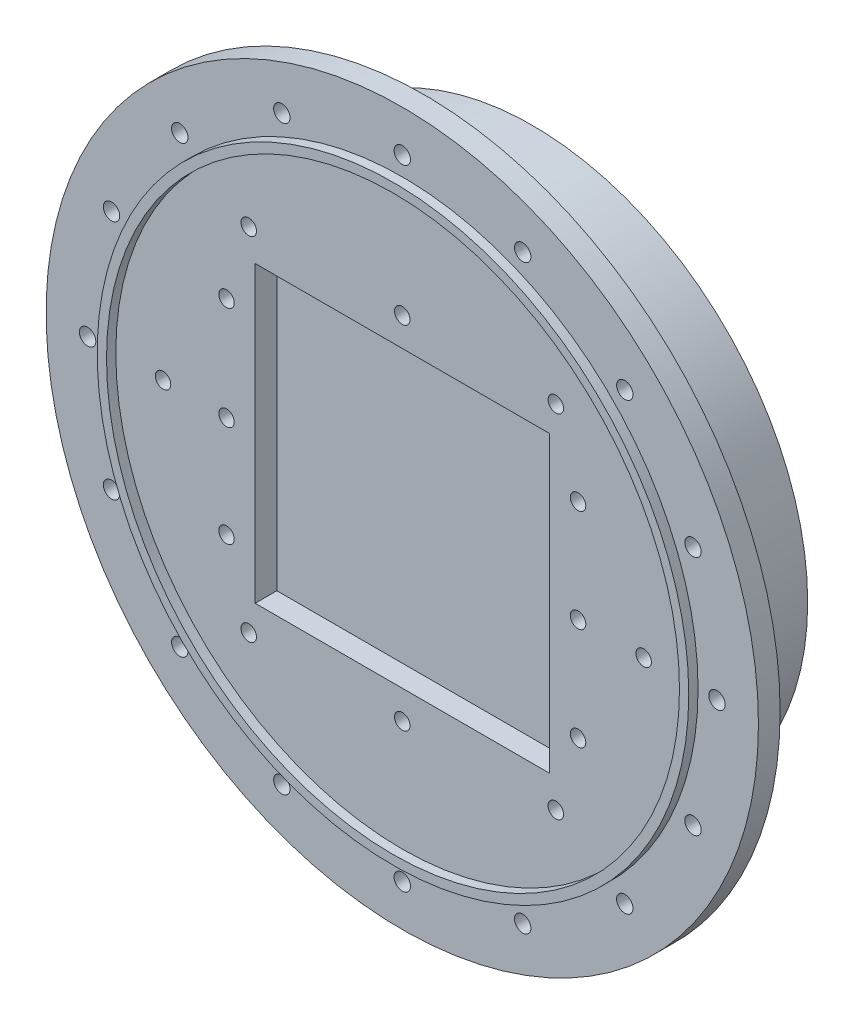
from build123d import *

# Parameters (mm, degrees)
SKETCH1_R                 = 115
SKETCH1_W                 = 95
SKETCH1_H                 = 95
BOSS_EXTRUDE1_DEPTH       = 7
SKETCH2_R                 = 95.5
SKETCH2_R_2               = 92.5
BOSS_EXTRUDE2_DEPTH       = 3
M6X1_0_TAPPED_HOLE4_D     = 5
M6X1_0_TAPPED_HOLE4_DEPTH = 17.018
M6X1_0_TAPPED_HOLE4_TIP   = 1.502151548
M6X1_0_TAPPED_HOLE5_D     = 5
M6X1_0_TAPPED_HOLE5_DEPTH = 17.018
M6X1_0_TAPPED_HOLE5_TIP   = 1.502151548
SKETCH10_R                = 88.9
BOSS_EXTRUDE3_DEPTH       = 35
CIRPATTERN2_COUNT         = 16


with BuildPart() as part:
    # Sketch1 → Boss-Extrude1 (new body)
    with BuildSketch(Plane.XY):
        Circle(SKETCH1_R)
        Rectangle(SKETCH1_W, SKETCH1_H, mode=Mode.SUBTRACT)
    extrude(amount=BOSS_EXTRUDE1_DEPTH)

    # Sketch2 → Boss-Extrude2 (add)
    with BuildSketch(Plane.XY.offset(7)):
        Circle(SKETCH2_R)
        Circle(SKETCH2_R_2, mode=Mode.SUBTRACT)
    extrude(amount=BOSS_EXTRUDE2_DEPTH)

    # M6x1.0 Tapped Hole4
    with Locations(Plane(origin=(-49.57572, 56.74995, 7), x_dir=(1, 0, 0), z_dir=(0, 0, 1))):
        with Locations((0, 0), (49.57572, 0), (99.15144, 0), (99.15144, -113.4999), (49.57572, -113.4999), (0, -113.4999), (-27.67457, -56.74995), (-7.17423, -56.997758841), (-7.17423, -23.69947), (-7.17423, -89.708525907), (106.32567, -23.69947), (106.32567, -56.74995), (106.32567, -89.80043)):
            Hole(M6X1_0_TAPPED_HOLE4_D / 2, depth=M6X1_0_TAPPED_HOLE4_DEPTH)
            with Locations((0, 0, -(M6X1_0_TAPPED_HOLE4_DEPTH + M6X1_0_TAPPED_HOLE4_TIP / 2))):  # 118° drill point
                Cone(0, M6X1_0_TAPPED_HOLE4_D / 2, M6X1_0_TAPPED_HOLE4_TIP, mode=Mode.SUBTRACT)

    # M6x1.0 Tapped Hole5
    with Locations(Plane(origin=(77.935880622, 0, 7), x_dir=(1, 0, 0), z_dir=(0, 0, 1))):
        with Locations((0, 0)):
            Hole(M6X1_0_TAPPED_HOLE5_D / 2, depth=M6X1_0_TAPPED_HOLE5_DEPTH)
            with Locations((0, 0, -(M6X1_0_TAPPED_HOLE5_DEPTH + M6X1_0_TAPPED_HOLE5_TIP / 2))):  # 118° drill point
                Cone(0, M6X1_0_TAPPED_HOLE5_D / 2, M6X1_0_TAPPED_HOLE5_TIP, mode=Mode.SUBTRACT)

    # Sketch10 → Boss-Extrude3 (add)
    with BuildSketch(Plane(origin=(0, 0, 0), x_dir=(-1, 0, 0), z_dir=(0, 0, -1))):
        with Locations(Location((0, 0, 0), (0, 0, 180))):
            Circle(SKETCH10_R)
    extrude(amount=BOSS_EXTRUDE3_DEPTH)

    # Sketch11 → M5 Clearance Hole1 (revolve, cut)
    with BuildSketch(Plane(origin=(0, 101.6, 7), x_dir=(0, -1, 0), z_dir=(1, 0, 0))):
        Polygon((0, 0), (0, 26.99228064), (2.65, 25.4), (2.65, 0), align=None)
    m5_clearance_hole1 = revolve(axis=Axis((0, 101.6, 13.35), (0, 0, -1)), mode=Mode.SUBTRACT)

    # CirPattern2: M5 Clearance Hole1 ×16 about axis
    cirpattern2_axis = Axis((0, 0, 0), (0, 0, 1))
    for i in range(1, CIRPATTERN2_COUNT):
        add(m5_clearance_hole1.rotate(cirpattern2_axis, i * 360 / CIRPATTERN2_COUNT), mode=Mode.SUBTRACT)


solid = part.part
